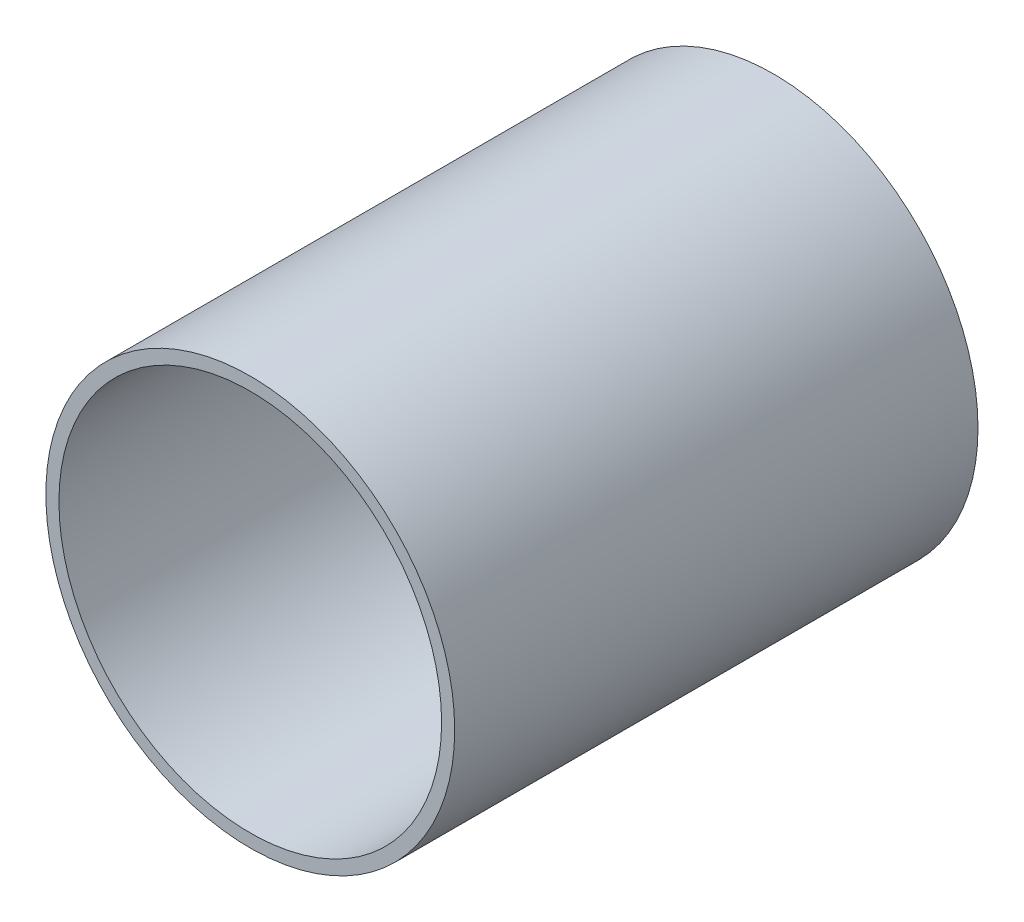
ISO-10303-21;
HEADER;
FILE_DESCRIPTION(('STEP AP214'),'2;1');
FILE_NAME('part.step','',(''),(''),'','','');
FILE_SCHEMA(('AUTOMOTIVE_DESIGN { 1 0 10303 214 1 1 1 1 }'));
ENDSEC;
DATA;
#1=APPLICATION_CONTEXT('core data for automotive mechanical design processes');
#2=APPLICATION_PROTOCOL_DEFINITION('international standard','automotive_design',2000,#1);
#3=PRODUCT_CONTEXT('',#1,'mechanical');
#4=PRODUCT('Part','Part','',(#3));
#5=PRODUCT_RELATED_PRODUCT_CATEGORY('part','',(#4));
#6=PRODUCT_DEFINITION_FORMATION('','',#4);
#7=PRODUCT_DEFINITION_CONTEXT('part definition',#1,'design');
#8=PRODUCT_DEFINITION('design','',#6,#7);
#9=PRODUCT_DEFINITION_SHAPE('','',#8);
#10=(LENGTH_UNIT() NAMED_UNIT(*) SI_UNIT(.MILLI.,.METRE.));
#11=(NAMED_UNIT(*) PLANE_ANGLE_UNIT() SI_UNIT($,.RADIAN.));
#12=(NAMED_UNIT(*) SI_UNIT($,.STERADIAN.) SOLID_ANGLE_UNIT());
#13=UNCERTAINTY_MEASURE_WITH_UNIT(LENGTH_MEASURE(1.E-05),#10,'distance_accuracy_value','');
#14=(GEOMETRIC_REPRESENTATION_CONTEXT(3) GLOBAL_UNCERTAINTY_ASSIGNED_CONTEXT((#13)) GLOBAL_UNIT_ASSIGNED_CONTEXT((#10,
#11,#12)) REPRESENTATION_CONTEXT('',''));
#15=CARTESIAN_POINT('',(0.,0.,0.));
#16=DIRECTION('',(0.,0.,1.));
#17=DIRECTION('',(1.,0.,0.));
#18=AXIS2_PLACEMENT_3D('',#15,#16,#17);
#19=CARTESIAN_POINT('',(0.,0.,160.));
#20=DIRECTION('',(0.,0.,1.));
#21=DIRECTION('',(1.,0.,0.));
#22=AXIS2_PLACEMENT_3D('',#19,#20,#21);
#23=PLANE('',#22);
#24=CARTESIAN_POINT('',(0.,0.,160.));
#25=DIRECTION('',(0.,0.,1.));
#26=DIRECTION('',(1.,0.,0.));
#27=AXIS2_PLACEMENT_3D('',#24,#25,#26);
#28=CIRCLE('',#27,62.5);
#29=CARTESIAN_POINT('',(62.5,0.,160.));
#30=VERTEX_POINT('',#29);
#31=EDGE_CURVE('E10',#30,#30,#28,.T.);
#32=ORIENTED_EDGE('',*,*,#31,.T.);
#33=EDGE_LOOP('',(#32));
#34=FACE_BOUND('',#33,.T.);
#35=CARTESIAN_POINT('',(0.,0.,160.));
#36=DIRECTION('',(0.,0.,1.));
#37=DIRECTION('',(1.,0.,0.));
#38=AXIS2_PLACEMENT_3D('',#35,#36,#37);
#39=CIRCLE('',#38,58.5);
#40=CARTESIAN_POINT('',(58.5,0.,160.));
#41=VERTEX_POINT('',#40);
#42=EDGE_CURVE('E48',#41,#41,#39,.T.);
#43=ORIENTED_EDGE('',*,*,#42,.F.);
#44=EDGE_LOOP('',(#43));
#45=FACE_BOUND('',#44,.T.);
#46=ADVANCED_FACE('F34',(#34,#45),#23,.T.);
#47=CARTESIAN_POINT('',(0.,0.,0.));
#48=DIRECTION('',(0.,0.,1.));
#49=DIRECTION('',(1.,0.,0.));
#50=AXIS2_PLACEMENT_3D('',#47,#48,#49);
#51=PLANE('',#50);
#52=CARTESIAN_POINT('',(0.,0.,0.));
#53=DIRECTION('',(0.,0.,1.));
#54=DIRECTION('',(1.,0.,0.));
#55=AXIS2_PLACEMENT_3D('',#52,#53,#54);
#56=CIRCLE('',#55,62.5);
#57=CARTESIAN_POINT('',(62.5,0.,0.));
#58=VERTEX_POINT('',#57);
#59=EDGE_CURVE('E38',#58,#58,#56,.T.);
#60=ORIENTED_EDGE('',*,*,#59,.F.);
#61=EDGE_LOOP('',(#60));
#62=FACE_BOUND('',#61,.T.);
#63=CARTESIAN_POINT('',(0.,0.,0.));
#64=DIRECTION('',(0.,0.,1.));
#65=DIRECTION('',(1.,0.,0.));
#66=AXIS2_PLACEMENT_3D('',#63,#64,#65);
#67=CIRCLE('',#66,58.5);
#68=CARTESIAN_POINT('',(58.5,0.,0.));
#69=VERTEX_POINT('',#68);
#70=EDGE_CURVE('E50',#69,#69,#67,.T.);
#71=ORIENTED_EDGE('',*,*,#70,.T.);
#72=EDGE_LOOP('',(#71));
#73=FACE_BOUND('',#72,.T.);
#74=ADVANCED_FACE('F63',(#62,#73),#51,.F.);
#75=CARTESIAN_POINT('',(0.,0.,160.));
#76=DIRECTION('',(0.,0.,-1.));
#77=DIRECTION('',(-1.,0.,0.));
#78=AXIS2_PLACEMENT_3D('',#75,#76,#77);
#79=CYLINDRICAL_SURFACE('',#78,62.5);
#80=ORIENTED_EDGE('',*,*,#31,.F.);
#81=EDGE_LOOP('',(#80));
#82=FACE_BOUND('',#81,.T.);
#83=ORIENTED_EDGE('',*,*,#59,.T.);
#84=EDGE_LOOP('',(#83));
#85=FACE_BOUND('',#84,.T.);
#86=ADVANCED_FACE('F36',(#82,#85),#79,.T.);
#87=CARTESIAN_POINT('',(0.,0.,160.));
#88=DIRECTION('',(0.,0.,-1.));
#89=DIRECTION('',(-1.,0.,0.));
#90=AXIS2_PLACEMENT_3D('',#87,#88,#89);
#91=CYLINDRICAL_SURFACE('',#90,58.5);
#92=ORIENTED_EDGE('',*,*,#42,.T.);
#93=EDGE_LOOP('',(#92));
#94=FACE_BOUND('',#93,.T.);
#95=ORIENTED_EDGE('',*,*,#70,.F.);
#96=EDGE_LOOP('',(#95));
#97=FACE_BOUND('',#96,.T.);
#98=ADVANCED_FACE('F59',(#94,#97),#91,.F.);
#99=CLOSED_SHELL('',(#46,#74,#86,#98));
#100=MANIFOLD_SOLID_BREP('B2',#99);
#101=ADVANCED_BREP_SHAPE_REPRESENTATION('',(#18,#100),#14);
#102=SHAPE_DEFINITION_REPRESENTATION(#9,#101);
ENDSEC;
END-ISO-10303-21;
